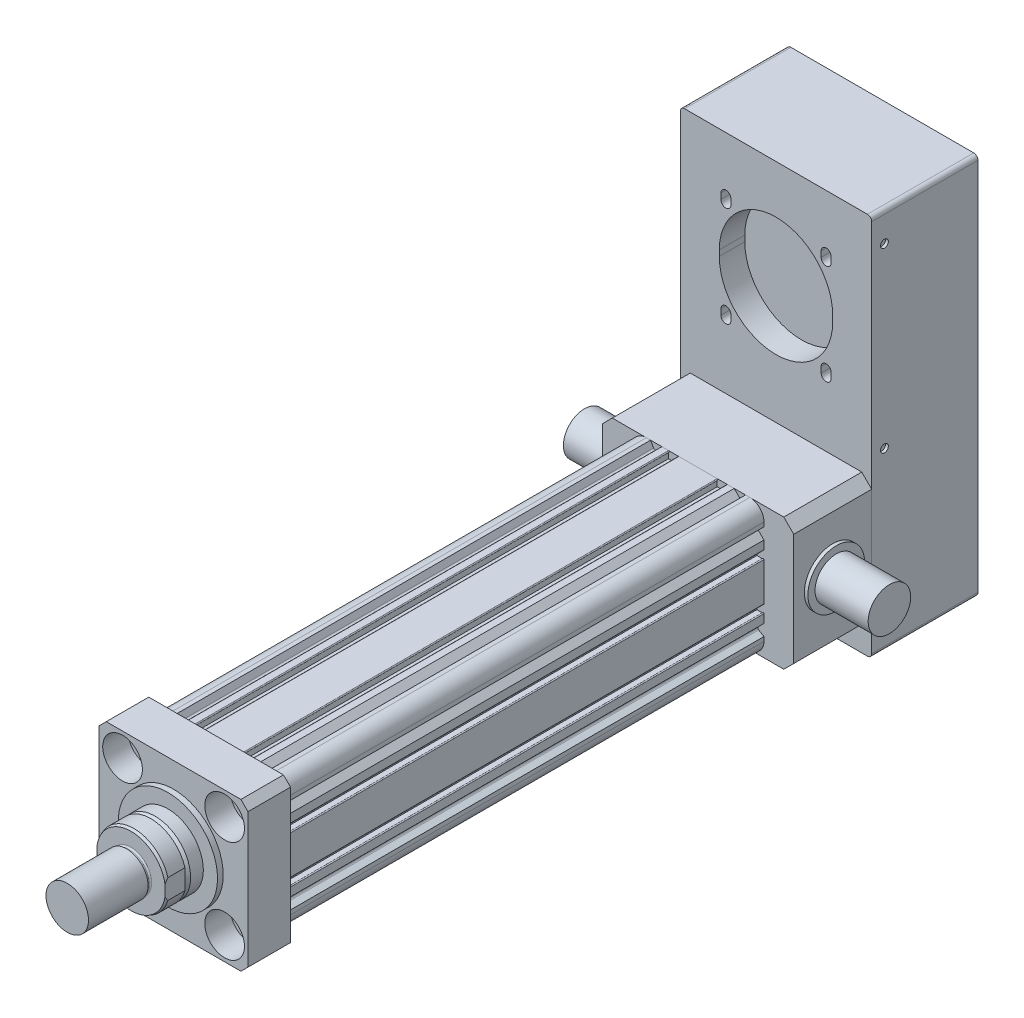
from build123d import *
from OCP.BRepFilletAPI import BRepFilletAPI_MakeChamfer

# Parameters (mm, degrees)
SKETCH_1_R           = 40
SKETCH_1_R_2         = 4.35
EXTRUDE_1_DEPTH      = 340
EXTRUDE_1_2_DEPTH    = 30
SKETCH_3_R           = 35
EXTRUDE_2_DEPTH      = 4
SKETCH_3_3_R         = 6.5
CUT_EXTRUDE_1_DEPTH  = 30
SKETCH_3_4_R         = 6.5
CUT_EXTRUDE_2_DEPTH  = 17
SKETCH_4_R           = 25
EXTRUDE_3_DEPTH      = 12
CHAMFER_1_SIZE       = 3
CHAMFER_1_SIZE2      = 1.732050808
EXTRUDE_4_DEPTH      = 14
CHAMFER_2_SIZE       = 2
CHAMFER_2_SIZE2      = 0.727940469
SKETCH_6_R           = 13.5
EXTRUDE_5_DEPTH      = 3
SKETCH_7_R           = 15
EXTRUDE_6_DEPTH      = 42
FILLET_1_R           = 1
SKETCH_8_W           = 135
SKETCH_8_H           = 93
EXTRUDE_7_DEPTH      = 55
SKETCH_12_W          = 135
SKETCH_12_H          = 270
EXTRUDE_9_DEPTH      = 75
CUT_EXTRUDE_5_DEPTH  = 18
CUT_EXTRUDE_6_DEPTH  = 18
CUT_EXTRUDE_START    = -11.5
CUT_EXTRUDE_7_DEPTH  = 6.5
SKETCH_14_R          = 2.75
CUT_EXTRUDE_8_DEPTH  = 2
SKETCH_15_R          = 2.75
CUT_EXTRUDE_9_DEPTH  = 2
SKETCH_16_R          = 20
EXTRUDE_10_DEPTH     = 2.5
EXTRUDE_START        = -135
SKETCH_16_2_R        = 20
EXTRUDE_11_DEPTH     = 2.5
SKETCH_17_R          = 15
EXTRUDE_12_DEPTH     = 37.5
EXTRUDE_START_2      = -140
SKETCH_17_2_R        = 15
EXTRUDE_13_DEPTH     = 37.5
CHAMFER_3_SIZE       = 7
SKETCH_18_W          = 105
SKETCH_18_H          = 105
EXTRUDE_14_DEPTH     = 30
SKETCH_19_R          = 14
CUT_EXTRUDE_10_DEPTH = 18
SKETCH_20_R          = 6.5
CUT_EXTRUDE_11_DEPTH = 30
CHAMFER_4_SIZE       = 5
FILLET_2_R           = 3


with BuildPart() as part:
    # Sketch 1 → Extrude 1 (new body)
    with BuildSketch(Plane.XY):
        with BuildLine():
            Line((46.5, -36.5), (46.5, -33.5))
            Line((46.5, -33.5), (42.782554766, -31.353731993))
            ThreePointArc((42.782554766, -31.353731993), (42.192820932, -30.47113294), (42.534026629, -29.465973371))
            Line((42.534026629, -29.465973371), (46.5, -25.5))
            Line((46.5, -25.5), (46.5, -19.6))
            ThreePointArc((46.5, -19.6), (46.353553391, -19.246446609), (46, -19.1))
            ThreePointArc((46, -19.1), (45.646446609, -19.246446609), (45.5, -19.6))
            Line((45.5, -19.6), (41.5, -19.6))
            Line((41.5, -19.6), (41.5, -13.5))
            Line((41.5, -13.5), (45.5, -13.5))
            ThreePointArc((45.5, -13.5), (45.646446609, -13.853553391), (46, -14))
            ThreePointArc((46, -14), (46.353553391, -13.853553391), (46.5, -13.5))
            Line((46.5, -13.5), (46.5, 13.5))
            ThreePointArc((46.5, 13.5), (46.353553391, 13.853553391), (46, 14))
            ThreePointArc((46, 14), (45.646446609, 13.853553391), (45.5, 13.5))
            Line((45.5, 13.5), (41.5, 13.5))
            Line((41.5, 13.5), (41.5, 19.6))
            Line((41.5, 19.6), (45.5, 19.6))
            ThreePointArc((45.5, 19.6), (45.646446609, 19.246446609), (46, 19.1))
            ThreePointArc((46, 19.1), (46.353553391, 19.246446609), (46.5, 19.6))
            Line((46.5, 19.6), (46.5, 25.5))
            Line((46.5, 25.5), (42.534026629, 29.465973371))
            ThreePointArc((42.534026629, 29.465973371), (42.192820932, 30.47113294), (42.782554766, 31.353731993))
            Line((42.782554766, 31.353731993), (46.5, 33.5))
            Line((46.5, 33.5), (46.5, 36.5))
            ThreePointArc((46.5, 36.5), (43.571067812, 43.571067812), (36.5, 46.5))
            Line((36.5, 46.5), (33.5, 46.5))
            Line((33.5, 46.5), (31.353731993, 42.782554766))
            ThreePointArc((31.353731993, 42.782554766), (30.47113294, 42.192820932), (29.465973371, 42.534026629))
            Line((29.465973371, 42.534026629), (25.5, 46.5))
            Line((25.5, 46.5), (20.8, 46.5))
            ThreePointArc((20.8, 46.5), (20.446446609, 46.353553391), (20.3, 46))
            ThreePointArc((20.3, 46), (20.446446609, 45.646446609), (20.8, 45.5))
            Line((20.8, 45.5), (20.8, 41.5))
            Line((20.8, 41.5), (13.5, 41.5))
            Line((13.5, 41.5), (13.5, 45.5))
            ThreePointArc((13.5, 45.5), (13.853553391, 45.646446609), (14, 46))
            ThreePointArc((14, 46), (13.853553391, 46.353553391), (13.5, 46.5))
            Line((13.5, 46.5), (-13.5, 46.5))
            ThreePointArc((-13.5, 46.5), (-13.853553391, 46.353553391), (-14, 46))
            ThreePointArc((-14, 46), (-13.853553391, 45.646446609), (-13.5, 45.5))
            Line((-13.5, 45.5), (-13.5, 41.5))
            Line((-13.5, 41.5), (-20.8, 41.5))
            Line((-20.8, 41.5), (-20.8, 45.5))
            ThreePointArc((-20.8, 45.5), (-20.446446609, 45.646446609), (-20.3, 46))
            ThreePointArc((-20.3, 46), (-20.446446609, 46.353553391), (-20.8, 46.5))
            Line((-20.8, 46.5), (-25.5, 46.5))
            Line((-25.5, 46.5), (-29.465973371, 42.534026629))
            ThreePointArc((-29.465973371, 42.534026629), (-30.47113294, 42.192820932), (-31.353731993, 42.782554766))
            Line((-31.353731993, 42.782554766), (-33.5, 46.5))
            Line((-33.5, 46.5), (-36.5, 46.5))
            ThreePointArc((-36.5, 46.5), (-43.571067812, 43.571067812), (-46.5, 36.5))
            Line((-46.5, 36.5), (-46.5, 33.5))
            Line((-46.5, 33.5), (-42.782554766, 31.353731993))
            ThreePointArc((-42.782554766, 31.353731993), (-42.192820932, 30.47113294), (-42.534026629, 29.465973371))
            Line((-42.534026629, 29.465973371), (-46.5, 25.5))
            Line((-46.5, 25.5), (-46.5, 20))
            ThreePointArc((-46.5, 20), (-46.353553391, 19.646446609), (-46, 19.5))
            ThreePointArc((-46, 19.5), (-45.646446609, 19.646446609), (-45.5, 20))
            Line((-45.5, 20), (-41.5, 20))
            Line((-41.5, 20), (-41.5, 13.9))
            Line((-41.5, 13.9), (-45.5, 13.9))
            ThreePointArc((-45.5, 13.9), (-45.646446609, 14.253553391), (-46, 14.4))
            ThreePointArc((-46, 14.4), (-46.353553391, 14.253553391), (-46.5, 13.9))
            Line((-46.5, 13.9), (-46.5, -13.9))
            ThreePointArc((-46.5, -13.9), (-46.353553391, -14.253553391), (-46, -14.4))
            ThreePointArc((-46, -14.4), (-45.646446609, -14.253553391), (-45.5, -13.9))
            Line((-45.5, -13.9), (-41.5, -13.9))
            Line((-41.5, -13.9), (-41.5, -20))
            Line((-41.5, -20), (-45.5, -20))
            ThreePointArc((-45.5, -20), (-45.646446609, -19.646446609), (-46, -19.5))
            ThreePointArc((-46, -19.5), (-46.353553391, -19.646446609), (-46.5, -20))
            Line((-46.5, -20), (-46.5, -25.5))
            Line((-46.5, -25.5), (-42.534026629, -29.465973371))
            ThreePointArc((-42.534026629, -29.465973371), (-42.192820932, -30.47113294), (-42.782554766, -31.353731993))
            Line((-42.782554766, -31.353731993), (-46.5, -33.5))
            Line((-46.5, -33.5), (-46.5, -36.5))
            ThreePointArc((-46.5, -36.5), (-43.571067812, -43.571067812), (-36.5, -46.5))
            Line((-36.5, -46.5), (-33.5, -46.5))
            Line((-33.5, -46.5), (-31.353731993, -42.782554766))
            ThreePointArc((-31.353731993, -42.782554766), (-30.47113294, -42.192820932), (-29.465973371, -42.534026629))
            Line((-29.465973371, -42.534026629), (-25.5, -46.5))
            Line((-25.5, -46.5), (25.5, -46.5))
            Line((25.5, -46.5), (29.465973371, -42.534026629))
            ThreePointArc((29.465973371, -42.534026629), (30.47113294, -42.192820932), (31.353731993, -42.782554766))
            Line((31.353731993, -42.782554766), (33.5, -46.5))
            Line((33.5, -46.5), (36.5, -46.5))
            ThreePointArc((36.5, -46.5), (43.571067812, -43.571067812), (46.5, -36.5))
        make_face()
        Circle(SKETCH_1_R, mode=Mode.SUBTRACT)
        with Locations((36, -36)):
            Circle(SKETCH_1_R_2, mode=Mode.SUBTRACT)
        with Locations((-36, -36)):
            Circle(SKETCH_1_R_2, mode=Mode.SUBTRACT)
        with Locations((36, 36)):
            Circle(SKETCH_1_R_2, mode=Mode.SUBTRACT)
        with Locations((-36, 36)):
            Circle(SKETCH_1_R_2, mode=Mode.SUBTRACT)
        with BuildLine():
            Line((25.75, -42.5), (11.324751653, -42.5))
            ThreePointArc((11.324751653, -42.5), (10.829080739, -42.065653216), (11.194582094, -41.517241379))
            ThreePointArc((11.194582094, -41.517241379), (18.919894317, -38.613956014), (25.948275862, -34.288292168))
            ThreePointArc((25.948275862, -34.288292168), (26.472640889, -34.239297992), (26.75, -34.68699324))
            Line((26.75, -34.68699324), (26.75, -41.5))
            Line((26.75, -41.5), (25.75, -42.5))
        make_face(mode=Mode.SUBTRACT)
        with BuildLine():
            Line((-25.75, -42.5), (-11.324751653, -42.5))
            ThreePointArc((-11.324751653, -42.5), (-10.829080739, -42.065653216), (-11.194582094, -41.517241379))
            ThreePointArc((-11.194582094, -41.517241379), (-18.919894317, -38.613956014), (-25.948275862, -34.288292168))
            ThreePointArc((-25.948275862, -34.288292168), (-26.472640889, -34.239297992), (-26.75, -34.68699324))
            Line((-26.75, -34.68699324), (-26.75, -41.5))
            Line((-26.75, -41.5), (-25.75, -42.5))
        make_face(mode=Mode.SUBTRACT)
        with BuildLine():
            Line((26.312283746, 40), (20.798294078, 40))
            ThreePointArc((20.798294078, 40), (20.548294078, 39.933012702), (20.365281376, 39.75))
            Line((20.365281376, 39.75), (19.794336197, 38.761093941))
            ThreePointArc((19.794336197, 38.761093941), (19.747068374, 38.372059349), (19.994850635, 38.068437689))
            ThreePointArc((19.994850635, 38.068437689), (22.57372353, 36.598183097), (25.045011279, 34.953503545))
            ThreePointArc((25.045011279, 34.953503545), (25.441798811, 34.871210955), (25.769245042, 35.109939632))
            Line((25.769245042, 35.109939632), (27.64187192, 38.353424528))
            ThreePointArc((27.64187192, 38.353424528), (27.704581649, 38.668687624), (27.562412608, 38.956977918))
            Line((27.562412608, 38.956977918), (26.665837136, 39.853553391))
            ThreePointArc((26.665837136, 39.853553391), (26.503625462, 39.961939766), (26.312283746, 40))
        make_face(mode=Mode.SUBTRACT)
        with BuildLine():
            Line((38.956977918, 27.562412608), (39.853553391, 26.665837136))
            ThreePointArc((39.853553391, 26.665837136), (39.961939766, 26.503625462), (40, 26.312283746))
            Line((40, 26.312283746), (40, 20.798294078))
            ThreePointArc((40, 20.798294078), (39.933012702, 20.548294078), (39.75, 20.365281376))
            Line((39.75, 20.365281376), (38.761093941, 19.794336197))
            ThreePointArc((38.761093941, 19.794336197), (38.372059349, 19.747068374), (38.068437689, 19.994850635))
            ThreePointArc((38.068437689, 19.994850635), (36.598183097, 22.57372353), (34.953503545, 25.045011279))
            ThreePointArc((34.953503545, 25.045011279), (34.871210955, 25.441798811), (35.109939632, 25.769245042))
            Line((35.109939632, 25.769245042), (38.353424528, 27.64187192))
            ThreePointArc((38.353424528, 27.64187192), (38.668687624, 27.704581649), (38.956977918, 27.562412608))
        make_face(mode=Mode.SUBTRACT)
        with BuildLine():
            Line((38.956977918, -27.562412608), (39.853553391, -26.665837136))
            ThreePointArc((39.853553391, -26.665837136), (39.961939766, -26.503625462), (40, -26.312283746))
            Line((40, -26.312283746), (40, -20.798294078))
            ThreePointArc((40, -20.798294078), (39.933012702, -20.548294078), (39.75, -20.365281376))
            Line((39.75, -20.365281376), (38.761093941, -19.794336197))
            ThreePointArc((38.761093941, -19.794336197), (38.372059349, -19.747068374), (38.068437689, -19.994850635))
            ThreePointArc((38.068437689, -19.994850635), (36.598183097, -22.57372353), (34.953503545, -25.045011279))
            ThreePointArc((34.953503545, -25.045011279), (34.871210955, -25.441798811), (35.109939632, -25.769245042))
            Line((35.109939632, -25.769245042), (38.353424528, -27.64187192))
            ThreePointArc((38.353424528, -27.64187192), (38.668687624, -27.704581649), (38.956977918, -27.562412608))
        make_face(mode=Mode.SUBTRACT)
        with BuildLine():
            Line((-39.75, -20.365281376), (-38.761093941, -19.794336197))
            ThreePointArc((-38.761093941, -19.794336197), (-38.372059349, -19.747068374), (-38.068437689, -19.994850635))
            ThreePointArc((-38.068437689, -19.994850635), (-36.598183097, -22.57372353), (-34.953503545, -25.045011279))
            ThreePointArc((-34.953503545, -25.045011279), (-34.871210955, -25.441798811), (-35.109939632, -25.769245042))
            Line((-35.109939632, -25.769245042), (-38.353424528, -27.64187192))
            ThreePointArc((-38.353424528, -27.64187192), (-38.668687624, -27.704581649), (-38.956977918, -27.562412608))
            Line((-38.956977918, -27.562412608), (-39.853553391, -26.665837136))
            ThreePointArc((-39.853553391, -26.665837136), (-39.961939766, -26.503625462), (-40, -26.312283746))
            Line((-40, -26.312283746), (-40, -20.798294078))
            ThreePointArc((-40, -20.798294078), (-39.933012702, -20.548294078), (-39.75, -20.365281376))
        make_face(mode=Mode.SUBTRACT)
        with BuildLine():
            Line((-20.365281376, 39.75), (-19.794336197, 38.761093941))
            ThreePointArc((-19.794336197, 38.761093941), (-19.747068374, 38.372059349), (-19.994850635, 38.068437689))
            ThreePointArc((-19.994850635, 38.068437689), (-22.57372353, 36.598183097), (-25.045011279, 34.953503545))
            ThreePointArc((-25.045011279, 34.953503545), (-25.441798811, 34.871210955), (-25.769245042, 35.109939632))
            Line((-25.769245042, 35.109939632), (-27.64187192, 38.353424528))
            ThreePointArc((-27.64187192, 38.353424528), (-27.704581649, 38.668687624), (-27.562412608, 38.956977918))
            Line((-27.562412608, 38.956977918), (-26.665837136, 39.853553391))
            ThreePointArc((-26.665837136, 39.853553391), (-26.503625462, 39.961939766), (-26.312283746, 40))
            Line((-26.312283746, 40), (-20.798294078, 40))
            ThreePointArc((-20.798294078, 40), (-20.548294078, 39.933012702), (-20.365281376, 39.75))
        make_face(mode=Mode.SUBTRACT)
        with BuildLine():
            Line((-38.956977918, 27.562412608), (-39.853553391, 26.665837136))
            ThreePointArc((-39.853553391, 26.665837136), (-39.961939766, 26.503625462), (-40, 26.312283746))
            Line((-40, 26.312283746), (-40, 20.798294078))
            ThreePointArc((-40, 20.798294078), (-39.933012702, 20.548294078), (-39.75, 20.365281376))
            Line((-39.75, 20.365281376), (-38.761093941, 19.794336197))
            ThreePointArc((-38.761093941, 19.794336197), (-38.372059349, 19.747068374), (-38.068437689, 19.994850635))
            ThreePointArc((-38.068437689, 19.994850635), (-36.598183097, 22.57372353), (-34.953503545, 25.045011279))
            ThreePointArc((-34.953503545, 25.045011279), (-34.871210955, 25.441798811), (-35.109939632, 25.769245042))
            Line((-35.109939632, 25.769245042), (-38.353424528, 27.64187192))
            ThreePointArc((-38.353424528, 27.64187192), (-38.668687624, 27.704581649), (-38.956977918, 27.562412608))
        make_face(mode=Mode.SUBTRACT)
    extrude(amount=EXTRUDE_1_DEPTH)

    # Sketch 2 → Extrude 1 2 (add)
    with BuildSketch(Plane.XY.offset(340)):
        Polygon((-52.5, 50.5), (-50.5, 52.5), (50.5, 52.5), (52.5, 50.5), (52.5, -50.5), (50.5, -52.5), (-50.5, -52.5), (-52.5, -50.5), align=None)
    extrude(amount=EXTRUDE_1_2_DEPTH)

    # Sketch 3 → Extrude 2 (add)
    with BuildSketch(Plane.XY.offset(370)):
        Circle(SKETCH_3_R)
    extrude(amount=EXTRUDE_2_DEPTH)

    # Sketch 3_3 → Cut-Extrude 1 (cut)
    with BuildSketch(Plane.XY.offset(370)):
        with Locations((-36, 36)):
            Circle(SKETCH_3_3_R)
        with Locations((36, 36)):
            Circle(SKETCH_3_3_R)
        with Locations((60, 32.5)):
            Circle(SKETCH_3_3_R)
        with Locations((36, -36)):
            Circle(SKETCH_3_3_R)
        with Locations((-36, -36)):
            Circle(SKETCH_3_3_R)
        with Locations((-60, -32.5)):
            Circle(SKETCH_3_3_R)
        with Locations((-60, 32.5)):
            Circle(SKETCH_3_3_R)
    extrude(amount=-CUT_EXTRUDE_1_DEPTH, mode=Mode.SUBTRACT)

    # Sketch 3_4 → Cut-Extrude 2 (cut)
    # profile 1 of 4: a face of its own
    with BuildSketch(Plane.XY.offset(370)):
        with BuildLine():
            Line((50, 52.5), (22, 52.5))
            Line((22, 52.5), (22, 36))
            ThreePointArc((22, 36), (36, 22), (50, 36))
            Line((50, 36), (50, 52.5))
        make_face()
        with Locations((36, 36)):
            Circle(SKETCH_3_4_R, mode=Mode.SUBTRACT)
    # profile 2 of 4: a face of its own
    with BuildSketch(Plane.XY.offset(370)):
        with BuildLine():
            Line((50, -52.5), (50, -36))
            ThreePointArc((50, -36), (36, -22), (22, -36))
            Line((22, -36), (22, -52.5))
            Line((22, -52.5), (50, -52.5))
        make_face()
        with Locations((36, -36)):
            Circle(SKETCH_3_4_R, mode=Mode.SUBTRACT)
    # profile 3 of 4: a face of its own
    with BuildSketch(Plane.XY.offset(370)):
        with BuildLine():
            Line((-50, -52.5), (-22, -52.5))
            Line((-22, -52.5), (-22, -36))
            ThreePointArc((-22, -36), (-36, -22), (-50, -36))
            Line((-50, -36), (-50, -52.5))
        make_face()
        with Locations((-36, -36)):
            Circle(SKETCH_3_4_R, mode=Mode.SUBTRACT)
    # profile 4 of 4: a face of its own
    with BuildSketch(Plane.XY.offset(370)):
        with BuildLine():
            Line((-50, 36), (-50, 52.5))
            Line((-50, 52.5), (-22, 52.5))
            Line((-22, 52.5), (-22, 36))
            ThreePointArc((-22, 36), (-36, 22), (-50, 36))
        make_face()
    extrude(amount=-CUT_EXTRUDE_2_DEPTH, mode=Mode.SUBTRACT)

    # Sketch 4 → Extrude 3 (add)
    with BuildSketch(Plane.XY.offset(374)):
        Circle(SKETCH_4_R)
    extrude(amount=EXTRUDE_3_DEPTH)

    # Chamfer 1
    chamfer_1_edges = [part.edges().sort_by_distance(p)[0] for p in [
        (-25, 0, 386),
    ]]
    chamfer_1_side = [part.faces().sort_by_distance(p)[0] for p in [
        (-25, 0, 380),
    ]]
    chamfer(chamfer_1_edges, length=CHAMFER_1_SIZE, length2=CHAMFER_1_SIZE2, reference=chamfer_1_side[0])

    # Sketch 5 → Extrude 4 (add)
    with BuildSketch(Plane.XY.offset(386)):
        with BuildLine():
            Line((-24, 7), (-24, -7))
            ThreePointArc((-24, -7), (0, -25), (24, -7))
            Line((24, -7), (24, 7))
            ThreePointArc((24, 7), (0, 25), (-24, 7))
        make_face()
    extrude(amount=EXTRUDE_4_DEPTH)

    # Chamfer 2: one chamfer whose edges measure the first distance from different faces: ONE call of the kernel's chamfer builder (chamfer() names one face for all edges)
    chamfer_2_edges_1 = [part.edges().sort_by_distance(p)[0] for p in [
        (0, 25, 400),
    ]]
    chamfer_2_side_1 = [part.faces().sort_by_distance(p)[0] for p in [
        (0, 25, 393),
    ]]
    chamfer_2_edges_2 = [part.edges().sort_by_distance(p)[0] for p in [
        (0, -25, 400),
    ]]
    chamfer_2_side_2 = [part.faces().sort_by_distance(p)[0] for p in [
        (0, -25, 393),
    ]]
    chamfer_2 = BRepFilletAPI_MakeChamfer(part.part.solid().wrapped)
    for e in chamfer_2_edges_1:
        chamfer_2.Add(CHAMFER_2_SIZE, CHAMFER_2_SIZE2, e.wrapped, chamfer_2_side_1[0].wrapped)  # the first distance lies on this face
    for e in chamfer_2_edges_2:
        chamfer_2.Add(CHAMFER_2_SIZE, CHAMFER_2_SIZE2, e.wrapped, chamfer_2_side_2[0].wrapped)  # the first distance lies on this face
    add(Compound.cast(chamfer_2.Shape()), mode=Mode.REPLACE)

    # Sketch 6 → Extrude 5 (add)
    with BuildSketch(Plane.XY.offset(400)):
        Circle(SKETCH_6_R)
    extrude(amount=EXTRUDE_5_DEPTH)

    # Sketch 7 → Extrude 6 (add)
    with BuildSketch(Plane.XY.offset(403)):
        with Locations(Location((0, 0, 0), (0, 0, 180))):
            Circle(SKETCH_7_R)
    extrude(amount=EXTRUDE_6_DEPTH)

    # Fillet 1
    fillet_1_edges = [part.edges().sort_by_distance(p)[0] for p in [
        (-13.5, 0, 400),
    ]]
    fillet(fillet_1_edges, radius=FILLET_1_R)

    # Sketch 18 → Extrude 14 (add)
    with BuildSketch(Plane.XY.offset(370)):
        Rectangle(SKETCH_18_W, SKETCH_18_H)
    extrude(amount=-EXTRUDE_14_DEPTH)

    # Sketch 19 → Cut-Extrude 10 (cut)
    with BuildSketch(Plane.XY.offset(370)):
        with Locations((-36, 36)):
            Circle(SKETCH_19_R)
        with Locations((36, 36)):
            Circle(SKETCH_19_R)
        with Locations((36, -36)):
            Circle(SKETCH_19_R)
        with Locations((-36, -36)):
            Circle(SKETCH_19_R)
    extrude(amount=-CUT_EXTRUDE_10_DEPTH, mode=Mode.SUBTRACT)

    # Sketch 20 → Cut-Extrude 11 (cut)
    with BuildSketch(Plane.XY.offset(352)):
        with Locations((-36, 36)):
            Circle(SKETCH_20_R)
        with Locations((36, 36)):
            Circle(SKETCH_20_R)
        with Locations((36, -36)):
            Circle(SKETCH_20_R)
        with Locations((-36, -36)):
            Circle(SKETCH_20_R)
    extrude(amount=-CUT_EXTRUDE_11_DEPTH, mode=Mode.SUBTRACT)

    # Chamfer 4
    chamfer_4_edges = [part.edges().sort_by_distance(p)[0] for p in [
        (52.5, 52.5, 355),
        (-52.5, -52.5, 355),
        (52.5, -52.5, 355),
        (-52.5, 52.5, 355),
    ]]
    chamfer(chamfer_4_edges, length=CHAMFER_4_SIZE)


with BuildPart() as body_2:
    # Sketch 8 → Extrude 7 (new body)
    with BuildSketch(Plane(origin=(0, 0, 0), x_dir=(-1, 0, 0), z_dir=(0, 0, -1))):
        Rectangle(SKETCH_8_W, SKETCH_8_H)
    extrude(amount=EXTRUDE_7_DEPTH)

    # Sketch 16 → Extrude 10 (add)
    with BuildSketch(Plane.ZY.offset(67.5)):
        with Locations((-27.5, 0)):
            Circle(SKETCH_16_R)
    extrude(amount=EXTRUDE_10_DEPTH)

    # Sketch 16_2 → Extrude 11 (add)
    with BuildSketch(Plane.ZY.offset(67.5).offset(EXTRUDE_START)):
        with Locations((-27.5, 0)):
            Circle(SKETCH_16_2_R)
    extrude(amount=-EXTRUDE_11_DEPTH)

    # Sketch 17 → Extrude 12 (add)
    with BuildSketch(Plane.ZY.offset(70)):
        with Locations((-27.5, 0)):
            Circle(SKETCH_17_R)
    extrude(amount=EXTRUDE_12_DEPTH)

    # Sketch 17_2 → Extrude 13 (add)
    with BuildSketch(Plane.ZY.offset(70).offset(EXTRUDE_START_2)):
        with Locations((-27.5, 0)):
            Circle(SKETCH_17_2_R)
    extrude(amount=-EXTRUDE_13_DEPTH)

    # Chamfer 3
    chamfer_3_edges = [body_2.edges().sort_by_distance(p)[0] for p in [
        (-67.5, -46.5, -27.5),
        (67.5, -46.5, -27.5),
        (67.5, 46.5, -27.5),
        (-67.5, 46.5, -27.5),
    ]]
    chamfer(chamfer_3_edges, length=CHAMFER_3_SIZE)


with BuildPart() as body_3:
    # Sketch 12 → Extrude 9 (new body)
    with BuildSketch(Plane(origin=(0, 0, -55), x_dir=(-1, 0, 0), z_dir=(0, 0, -1))):
        with Locations((0, 71)):
            Rectangle(SKETCH_12_W, SKETCH_12_H)
    extrude(amount=EXTRUDE_9_DEPTH)

    # Sketch 13 → Cut-Extrude 5 (cut)
    with BuildSketch(Plane.XY.offset(-55)):
        with BuildLine():
            Line((-40, 132), (-40, 128))
            ThreePointArc((-40, 128), (0, 88), (40, 128))
            Line((40, 128), (40, 132))
            ThreePointArc((40, 132), (0, 172), (-40, 132))
        make_face()
    extrude(amount=-CUT_EXTRUDE_5_DEPTH, mode=Mode.SUBTRACT)

    # Sketch 13_3 → Cut-Extrude 6 (cut)
    with BuildSketch(Plane.XY.offset(-55)):
        with BuildLine():
            ThreePointArc((31.855339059, 167.355339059), (35.355339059, 170.855339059), (38.855339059, 167.355339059))
            Line((38.855339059, 167.355339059), (38.855339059, 163.355339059))
            ThreePointArc((38.855339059, 163.355339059), (35.355339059, 159.855339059), (31.855339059, 163.355339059))
            Line((31.855339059, 163.355339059), (31.855339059, 167.355339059))
        make_face()
        with BuildLine():
            ThreePointArc((-31.855339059, 92.644660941), (-35.355339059, 89.144660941), (-38.855339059, 92.644660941))
            Line((-38.855339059, 92.644660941), (-38.855339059, 96.644660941))
            ThreePointArc((-38.855339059, 96.644660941), (-35.355339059, 100.144660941), (-31.855339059, 96.644660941))
            Line((-31.855339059, 96.644660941), (-31.855339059, 92.644660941))
        make_face()
        with BuildLine():
            ThreePointArc((-31.855339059, 167.355339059), (-35.355339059, 170.855339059), (-38.855339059, 167.355339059))
            Line((-38.855339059, 167.355339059), (-38.855339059, 163.355339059))
            ThreePointArc((-38.855339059, 163.355339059), (-35.355339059, 159.855339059), (-31.855339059, 163.355339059))
            Line((-31.855339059, 163.355339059), (-31.855339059, 167.355339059))
        make_face()
        with BuildLine():
            ThreePointArc((38.855339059, 96.644660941), (35.355339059, 100.144660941), (31.855339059, 96.644660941))
            Line((31.855339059, 96.644660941), (31.855339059, 92.644660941))
            ThreePointArc((31.855339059, 92.644660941), (35.355339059, 89.144660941), (38.855339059, 92.644660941))
            Line((38.855339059, 92.644660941), (38.855339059, 96.644660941))
        make_face()
    extrude(amount=-CUT_EXTRUDE_6_DEPTH, mode=Mode.SUBTRACT)

    # Sketch 13_4 → Cut-Extrude 7 (cut)
    with BuildSketch(Plane.XY.offset(-55).offset(CUT_EXTRUDE_START)):
        with BuildLine():
            Line((-40.555339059, 163.305339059), (-40.555339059, 167.405339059))
            ThreePointArc((-40.555339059, 167.405339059), (-35.355339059, 172.605339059), (-30.155339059, 167.405339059))
            Line((-30.155339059, 167.405339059), (-30.155339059, 163.305339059))
            ThreePointArc((-30.155339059, 163.305339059), (-35.355339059, 158.105339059), (-40.555339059, 163.305339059))
        make_face()
        with BuildLine():
            Line((40.555339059, 163.305339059), (40.555339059, 167.405339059))
            ThreePointArc((40.555339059, 167.405339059), (35.355339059, 172.605339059), (30.155339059, 167.405339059))
            Line((30.155339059, 167.405339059), (30.155339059, 163.305339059))
            ThreePointArc((30.155339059, 163.305339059), (35.355339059, 158.105339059), (40.555339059, 163.305339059))
        make_face()
        with BuildLine():
            Line((40.555339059, 96.694660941), (40.555339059, 92.594660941))
            ThreePointArc((40.555339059, 92.594660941), (35.355339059, 87.394660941), (30.155339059, 92.594660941))
            Line((30.155339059, 92.594660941), (30.155339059, 96.694660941))
            ThreePointArc((30.155339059, 96.694660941), (35.355339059, 101.894660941), (40.555339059, 96.694660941))
        make_face()
        with BuildLine():
            Line((-40.555339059, 96.694660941), (-40.555339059, 92.594660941))
            ThreePointArc((-40.555339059, 92.594660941), (-35.355339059, 87.394660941), (-30.155339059, 92.594660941))
            Line((-30.155339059, 92.594660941), (-30.155339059, 96.694660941))
            ThreePointArc((-30.155339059, 96.694660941), (-35.355339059, 101.894660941), (-40.555339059, 96.694660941))
        make_face()
    extrude(amount=-CUT_EXTRUDE_7_DEPTH, mode=Mode.SUBTRACT)

    # Sketch 14 → Cut-Extrude 8 (cut)
    with BuildSketch(Plane.ZY.offset(67.5)):
        with Locations(Location((-64, -50, 0), (0, 0, 270))):
            Circle(SKETCH_14_R)
        with Locations(Location((-64, 60, 0), (0, 0, 270))):
            Circle(SKETCH_14_R)
        with Locations(Location((-64, 185, 0), (0, 0, 270))):
            Circle(SKETCH_14_R)
    extrude(amount=-CUT_EXTRUDE_8_DEPTH, mode=Mode.SUBTRACT)

    # Sketch 15 → Cut-Extrude 9 (cut)
    with BuildSketch(Plane(origin=(67.5, 0, 0), x_dir=(0, 0, -1), z_dir=(1, 0, 0))):
        with Locations(Location((64, -50, 0), (0, 0, 270))):
            Circle(SKETCH_15_R)
        with Locations(Location((64, 60, 0), (0, 0, 270))):
            Circle(SKETCH_15_R)
        with Locations(Location((64, 185, 0), (0, 0, 270))):
            Circle(SKETCH_15_R)
    extrude(amount=-CUT_EXTRUDE_9_DEPTH, mode=Mode.SUBTRACT)

    # Fillet 2
    fillet_2_edges = [body_3.edges().sort_by_distance(p)[0] for p in [
        (-67.5, -64, -92.5),
        (67.5, -64, -92.5),
        (67.5, 206, -92.5),
        (-67.5, 206, -92.5),
    ]]
    fillet(fillet_2_edges, radius=FILLET_2_R)


solid = Compound([part.part, body_2.part, body_3.part])
